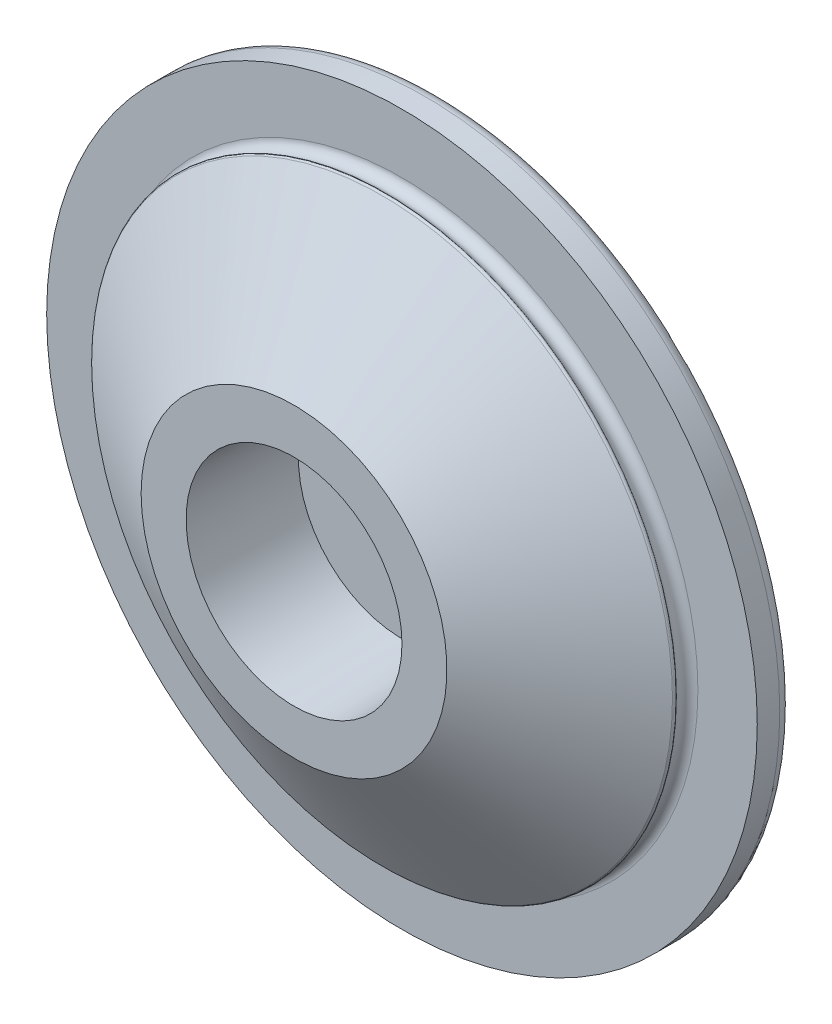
ISO-10303-21;
HEADER;
FILE_DESCRIPTION(('STEP AP214'),'2;1');
FILE_NAME('part.step','',(''),(''),'','','');
FILE_SCHEMA(('AUTOMOTIVE_DESIGN { 1 0 10303 214 1 1 1 1 }'));
ENDSEC;
DATA;
#1=APPLICATION_CONTEXT('core data for automotive mechanical design processes');
#2=APPLICATION_PROTOCOL_DEFINITION('international standard','automotive_design',2000,#1);
#3=PRODUCT_CONTEXT('',#1,'mechanical');
#4=PRODUCT('Part','Part','',(#3));
#5=PRODUCT_RELATED_PRODUCT_CATEGORY('part','',(#4));
#6=PRODUCT_DEFINITION_FORMATION('','',#4);
#7=PRODUCT_DEFINITION_CONTEXT('part definition',#1,'design');
#8=PRODUCT_DEFINITION('design','',#6,#7);
#9=PRODUCT_DEFINITION_SHAPE('','',#8);
#10=(LENGTH_UNIT() NAMED_UNIT(*) SI_UNIT(.MILLI.,.METRE.));
#11=(NAMED_UNIT(*) PLANE_ANGLE_UNIT() SI_UNIT($,.RADIAN.));
#12=(NAMED_UNIT(*) SI_UNIT($,.STERADIAN.) SOLID_ANGLE_UNIT());
#13=UNCERTAINTY_MEASURE_WITH_UNIT(LENGTH_MEASURE(1.E-05),#10,'distance_accuracy_value','');
#14=(GEOMETRIC_REPRESENTATION_CONTEXT(3) GLOBAL_UNCERTAINTY_ASSIGNED_CONTEXT((#13)) GLOBAL_UNIT_ASSIGNED_CONTEXT((#10,
#11,#12)) REPRESENTATION_CONTEXT('',''));
#15=CARTESIAN_POINT('',(0.,0.,0.));
#16=DIRECTION('',(0.,0.,1.));
#17=DIRECTION('',(1.,0.,0.));
#18=AXIS2_PLACEMENT_3D('',#15,#16,#17);
#19=CARTESIAN_POINT('',(5.75,0.,4.));
#20=DIRECTION('',(0.,0.,1.));
#21=DIRECTION('',(1.,0.,0.));
#22=AXIS2_PLACEMENT_3D('',#19,#20,#21);
#23=PLANE('',#22);
#24=CARTESIAN_POINT('',(0.,0.,3.99999999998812));
#25=DIRECTION('',(0.,0.,1.));
#26=DIRECTION('',(1.,0.,0.));
#27=AXIS2_PLACEMENT_3D('',#24,#25,#26);
#28=CIRCLE('',#27,11.5000000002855);
#29=CARTESIAN_POINT('',(11.5000000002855,0.,3.99999999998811));
#30=VERTEX_POINT('',#29);
#31=EDGE_CURVE('E17',#30,#30,#28,.T.);
#32=ORIENTED_EDGE('',*,*,#31,.T.);
#33=EDGE_LOOP('',(#32));
#34=FACE_BOUND('',#33,.T.);
#35=ADVANCED_FACE('F13',(#34),#23,.T.);
#36=CARTESIAN_POINT('',(0.,0.,16.0000000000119));
#37=DIRECTION('',(0.,0.,1.));
#38=DIRECTION('',(1.,0.,0.));
#39=AXIS2_PLACEMENT_3D('',#36,#37,#38);
#40=CONICAL_SURFACE('',#39,11.9999999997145,0.0416425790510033);
#41=CARTESIAN_POINT('',(0.,0.,16.0000000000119));
#42=DIRECTION('',(0.,0.,1.));
#43=DIRECTION('',(1.,0.,0.));
#44=AXIS2_PLACEMENT_3D('',#41,#42,#43);
#45=CIRCLE('',#44,11.9999999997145);
#46=CARTESIAN_POINT('',(11.9999999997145,0.,16.0000000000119));
#47=VERTEX_POINT('',#46);
#48=EDGE_CURVE('E86',#47,#47,#45,.F.);
#49=ORIENTED_EDGE('',*,*,#48,.F.);
#50=EDGE_LOOP('',(#49));
#51=FACE_BOUND('',#50,.T.);
#52=ORIENTED_EDGE('',*,*,#31,.F.);
#53=EDGE_LOOP('',(#52));
#54=FACE_BOUND('',#53,.T.);
#55=ADVANCED_FACE('F94',(#51,#54),#40,.F.);
#56=CARTESIAN_POINT('',(14.5,0.,16.));
#57=DIRECTION('',(0.,0.,1.));
#58=DIRECTION('',(1.,0.,0.));
#59=AXIS2_PLACEMENT_3D('',#56,#57,#58);
#60=PLANE('',#59);
#61=ORIENTED_EDGE('',*,*,#48,.T.);
#62=EDGE_LOOP('',(#61));
#63=FACE_BOUND('',#62,.T.);
#64=CARTESIAN_POINT('',(0.,0.,16.0000000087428));
#65=DIRECTION('',(0.,0.,-1.));
#66=DIRECTION('',(-1.,0.,0.));
#67=AXIS2_PLACEMENT_3D('',#64,#65,#66);
#68=CIRCLE('',#67,17.0000000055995);
#69=CARTESIAN_POINT('',(-17.0000000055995,0.,16.0000000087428));
#70=VERTEX_POINT('',#69);
#71=EDGE_CURVE('E80',#70,#70,#68,.T.);
#72=ORIENTED_EDGE('',*,*,#71,.F.);
#73=EDGE_LOOP('',(#72));
#74=FACE_BOUND('',#73,.T.);
#75=ADVANCED_FACE('F96',(#63,#74),#60,.T.);
#76=CARTESIAN_POINT('',(0.,0.,6.21052290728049));
#77=DIRECTION('',(0.,0.,-1.));
#78=DIRECTION('',(-1.,0.,0.));
#79=AXIS2_PLACEMENT_3D('',#76,#77,#78);
#80=CONICAL_SURFACE('',#79,32.2848336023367,1.00114979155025);
#81=CARTESIAN_POINT('',(0.,0.,6.21052291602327));
#82=DIRECTION('',(0.,0.,1.));
#83=DIRECTION('',(1.,0.,0.));
#84=AXIS2_PLACEMENT_3D('',#81,#82,#83);
#85=CIRCLE('',#84,32.2848336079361);
#86=CARTESIAN_POINT('',(32.2848336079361,0.,6.21052291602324));
#87=VERTEX_POINT('',#86);
#88=EDGE_CURVE('E77',#87,#87,#85,.F.);
#89=ORIENTED_EDGE('',*,*,#88,.F.);
#90=EDGE_LOOP('',(#89));
#91=FACE_BOUND('',#90,.T.);
#92=ORIENTED_EDGE('',*,*,#71,.T.);
#93=EDGE_LOOP('',(#92));
#94=FACE_BOUND('',#93,.T.);
#95=ADVANCED_FACE('F71',(#91,#94),#80,.T.);
#96=CARTESIAN_POINT('',(0.,0.,6.00000000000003));
#97=DIRECTION('',(0.,0.,1.));
#98=DIRECTION('',(1.,0.,0.));
#99=AXIS2_PLACEMENT_3D('',#96,#97,#98);
#100=TOROIDAL_SURFACE('',#99,32.15,0.25);
#101=CARTESIAN_POINT('',(0.,0.,5.80000000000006));
#102=DIRECTION('',(0.,0.,-1.));
#103=DIRECTION('',(-1.,0.,0.));
#104=AXIS2_PLACEMENT_3D('',#101,#102,#103);
#105=CIRCLE('',#104,32.3);
#106=CARTESIAN_POINT('',(-32.3,0.,5.80000000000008));
#107=VERTEX_POINT('',#106);
#108=EDGE_CURVE('E45',#107,#107,#105,.T.);
#109=ORIENTED_EDGE('',*,*,#108,.F.);
#110=EDGE_LOOP('',(#109));
#111=FACE_BOUND('',#110,.T.);
#112=ORIENTED_EDGE('',*,*,#88,.T.);
#113=EDGE_LOOP('',(#112));
#114=FACE_BOUND('',#113,.T.);
#115=ADVANCED_FACE('F67',(#111,#114),#100,.T.);
#116=CARTESIAN_POINT('',(0.,0.,5.00000000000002));
#117=DIRECTION('',(0.,0.,1.));
#118=DIRECTION('',(1.,0.,0.));
#119=AXIS2_PLACEMENT_3D('',#116,#117,#118);
#120=TOROIDAL_SURFACE('',#119,32.9,1.00000000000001);
#121=CARTESIAN_POINT('',(0.,0.,4.00000000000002));
#122=DIRECTION('',(0.,0.,1.));
#123=DIRECTION('',(1.,0.,0.));
#124=AXIS2_PLACEMENT_3D('',#121,#122,#123);
#125=CIRCLE('',#124,32.9);
#126=CARTESIAN_POINT('',(32.9,0.,3.99999999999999));
#127=VERTEX_POINT('',#126);
#128=EDGE_CURVE('E31',#127,#127,#125,.F.);
#129=ORIENTED_EDGE('',*,*,#128,.F.);
#130=EDGE_LOOP('',(#129));
#131=FACE_BOUND('',#130,.T.);
#132=ORIENTED_EDGE('',*,*,#108,.T.);
#133=EDGE_LOOP('',(#132));
#134=FACE_BOUND('',#133,.T.);
#135=ADVANCED_FACE('F15',(#131,#134),#120,.F.);
#136=CARTESIAN_POINT('',(36.2,0.,4.));
#137=DIRECTION('',(0.,0.,1.));
#138=DIRECTION('',(1.,0.,0.));
#139=AXIS2_PLACEMENT_3D('',#136,#137,#138);
#140=PLANE('',#139);
#141=ORIENTED_EDGE('',*,*,#128,.T.);
#142=EDGE_LOOP('',(#141));
#143=FACE_BOUND('',#142,.T.);
#144=CARTESIAN_POINT('',(0.,0.,4.00000000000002));
#145=DIRECTION('',(0.,0.,1.));
#146=DIRECTION('',(1.,0.,0.));
#147=AXIS2_PLACEMENT_3D('',#144,#145,#146);
#148=CIRCLE('',#147,39.5);
#149=CARTESIAN_POINT('',(39.5,0.,4.));
#150=VERTEX_POINT('',#149);
#151=EDGE_CURVE('E26',#150,#150,#148,.F.);
#152=ORIENTED_EDGE('',*,*,#151,.F.);
#153=EDGE_LOOP('',(#152));
#154=FACE_BOUND('',#153,.T.);
#155=ADVANCED_FACE('F62',(#143,#154),#140,.T.);
#156=CARTESIAN_POINT('',(0.,0.,2.75000000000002));
#157=DIRECTION('',(0.,0.,1.));
#158=DIRECTION('',(1.,0.,0.));
#159=AXIS2_PLACEMENT_3D('',#156,#157,#158);
#160=CYLINDRICAL_SURFACE('',#159,39.5);
#161=CARTESIAN_POINT('',(0.,0.,1.50000000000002));
#162=DIRECTION('',(0.,0.,1.));
#163=DIRECTION('',(1.,0.,0.));
#164=AXIS2_PLACEMENT_3D('',#161,#162,#163);
#165=CIRCLE('',#164,39.5);
#166=CARTESIAN_POINT('',(39.5,0.,1.49999999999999));
#167=VERTEX_POINT('',#166);
#168=EDGE_CURVE('E21',#167,#167,#165,.F.);
#169=ORIENTED_EDGE('',*,*,#168,.F.);
#170=EDGE_LOOP('',(#169));
#171=FACE_BOUND('',#170,.T.);
#172=ORIENTED_EDGE('',*,*,#151,.T.);
#173=EDGE_LOOP('',(#172));
#174=FACE_BOUND('',#173,.T.);
#175=ADVANCED_FACE('F58',(#171,#174),#160,.T.);
#176=CARTESIAN_POINT('',(0.,0.,1.50000000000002));
#177=DIRECTION('',(0.,0.,1.));
#178=DIRECTION('',(1.,0.,0.));
#179=AXIS2_PLACEMENT_3D('',#176,#177,#178);
#180=TOROIDAL_SURFACE('',#179,38.,1.5);
#181=CARTESIAN_POINT('',(0.,0.,0.));
#182=DIRECTION('',(0.,0.,1.));
#183=DIRECTION('',(1.,0.,0.));
#184=AXIS2_PLACEMENT_3D('',#181,#182,#183);
#185=CIRCLE('',#184,38.);
#186=CARTESIAN_POINT('',(38.,0.,0.));
#187=VERTEX_POINT('',#186);
#188=EDGE_CURVE('E9',#187,#187,#185,.F.);
#189=ORIENTED_EDGE('',*,*,#188,.F.);
#190=EDGE_LOOP('',(#189));
#191=FACE_BOUND('',#190,.T.);
#192=ORIENTED_EDGE('',*,*,#168,.T.);
#193=EDGE_LOOP('',(#192));
#194=FACE_BOUND('',#193,.T.);
#195=ADVANCED_FACE('F47',(#191,#194),#180,.T.);
#196=CARTESIAN_POINT('',(19.,0.,0.));
#197=DIRECTION('',(0.,0.,-1.));
#198=DIRECTION('',(-1.,0.,0.));
#199=AXIS2_PLACEMENT_3D('',#196,#197,#198);
#200=PLANE('',#199);
#201=ORIENTED_EDGE('',*,*,#188,.T.);
#202=EDGE_LOOP('',(#201));
#203=FACE_BOUND('',#202,.T.);
#204=ADVANCED_FACE('F57',(#203),#200,.T.);
#205=CLOSED_SHELL('',(#35,#55,#75,#95,#115,#135,#155,#175,#195,#204));
#206=MANIFOLD_SOLID_BREP('B1',#205);
#207=ADVANCED_BREP_SHAPE_REPRESENTATION('',(#18,#206),#14);
#208=SHAPE_DEFINITION_REPRESENTATION(#9,#207);
ENDSEC;
END-ISO-10303-21;
